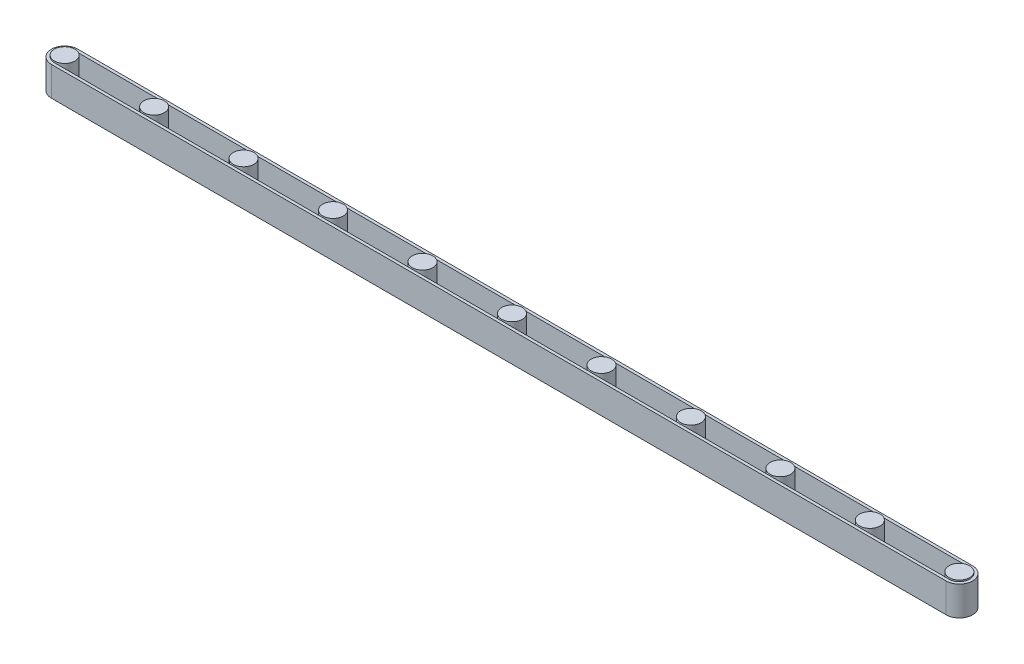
from build123d import *

# Parameters (mm, degrees)
SKETCH1_R              = 35
BOSS_EXTRUDE1_DEPTH    = 55
BOSS_EXTRUDE1_2_DEPTH  = 55
BOSS_EXTRUDE1_3_DEPTH  = 55
BOSS_EXTRUDE1_4_DEPTH  = 55
BOSS_EXTRUDE1_5_DEPTH  = 55
BOSS_EXTRUDE1_6_DEPTH  = 55
BOSS_EXTRUDE1_7_DEPTH  = 55
BOSS_EXTRUDE1_8_DEPTH  = 55
BOSS_EXTRUDE1_9_DEPTH  = 55
BOSS_EXTRUDE1_10_DEPTH = 55
BOSS_EXTRUDE1_11_DEPTH = 55
BOSS_EXTRUDE2_DEPTH    = 50


with BuildPart() as part:
    # Sketch1 → Boss-Extrude1 (new, symmetric)
    with BuildSketch(Plane(origin=(0, 0, 0), x_dir=(1, 0, 0), z_dir=(0, 1, 0))):
        with Locations(Location((0, 0, 0), (0, 0, 270))):
            Circle(SKETCH1_R)
    extrude(amount=BOSS_EXTRUDE1_DEPTH, both=True)


with BuildPart() as body_2:
    # Sketch1 → Boss-Extrude1 2 (new, symmetric)
    with BuildSketch(Plane(origin=(0, 0, 0), x_dir=(1, 0, 0), z_dir=(0, 1, 0))):
        with Locations(Location((3050, 0, 0), (0, 0, 270))):
            Circle(SKETCH1_R)
    extrude(amount=BOSS_EXTRUDE1_2_DEPTH, both=True)


with BuildPart() as body_3:
    # Sketch1 → Boss-Extrude1 3 (new, symmetric)
    with BuildSketch(Plane(origin=(0, 0, 0), x_dir=(1, 0, 0), z_dir=(0, 1, 0))):
        with Locations(Location((305, 0, 0), (0, 0, 270))):
            Circle(SKETCH1_R)
    extrude(amount=BOSS_EXTRUDE1_3_DEPTH, both=True)


with BuildPart() as body_4:
    # Sketch1 → Boss-Extrude1 4 (new, symmetric)
    with BuildSketch(Plane(origin=(0, 0, 0), x_dir=(1, 0, 0), z_dir=(0, 1, 0))):
        with Locations(Location((610, 0, 0), (0, 0, 270))):
            Circle(SKETCH1_R)
    extrude(amount=BOSS_EXTRUDE1_4_DEPTH, both=True)


with BuildPart() as body_5:
    # Sketch1 → Boss-Extrude1 5 (new, symmetric)
    with BuildSketch(Plane(origin=(0, 0, 0), x_dir=(1, 0, 0), z_dir=(0, 1, 0))):
        with Locations(Location((915, 0, 0), (0, 0, 270))):
            Circle(SKETCH1_R)
    extrude(amount=BOSS_EXTRUDE1_5_DEPTH, both=True)


with BuildPart() as body_6:
    # Sketch1 → Boss-Extrude1 6 (new, symmetric)
    with BuildSketch(Plane(origin=(0, 0, 0), x_dir=(1, 0, 0), z_dir=(0, 1, 0))):
        with Locations(Location((1220, 0, 0), (0, 0, 270))):
            Circle(SKETCH1_R)
    extrude(amount=BOSS_EXTRUDE1_6_DEPTH, both=True)


with BuildPart() as body_7:
    # Sketch1 → Boss-Extrude1 7 (new, symmetric)
    with BuildSketch(Plane(origin=(0, 0, 0), x_dir=(1, 0, 0), z_dir=(0, 1, 0))):
        with Locations(Location((1830, 0, 0), (0, 0, 270))):
            Circle(SKETCH1_R)
    extrude(amount=BOSS_EXTRUDE1_7_DEPTH, both=True)


with BuildPart() as body_8:
    # Sketch1 → Boss-Extrude1 8 (new, symmetric)
    with BuildSketch(Plane(origin=(0, 0, 0), x_dir=(1, 0, 0), z_dir=(0, 1, 0))):
        with Locations(Location((1525, 0, 0), (0, 0, 270))):
            Circle(SKETCH1_R)
    extrude(amount=BOSS_EXTRUDE1_8_DEPTH, both=True)


with BuildPart() as body_9:
    # Sketch1 → Boss-Extrude1 9 (new, symmetric)
    with BuildSketch(Plane(origin=(0, 0, 0), x_dir=(1, 0, 0), z_dir=(0, 1, 0))):
        with Locations(Location((2135, 0, 0), (0, 0, 270))):
            Circle(SKETCH1_R)
    extrude(amount=BOSS_EXTRUDE1_9_DEPTH, both=True)


with BuildPart() as body_10:
    # Sketch1 → Boss-Extrude1 10 (new, symmetric)
    with BuildSketch(Plane(origin=(0, 0, 0), x_dir=(1, 0, 0), z_dir=(0, 1, 0))):
        with Locations(Location((2440, 0, 0), (0, 0, 270))):
            Circle(SKETCH1_R)
    extrude(amount=BOSS_EXTRUDE1_10_DEPTH, both=True)


with BuildPart() as body_11:
    # Sketch1 → Boss-Extrude1 11 (new, symmetric)
    with BuildSketch(Plane(origin=(0, 0, 0), x_dir=(1, 0, 0), z_dir=(0, 1, 0))):
        with Locations(Location((2745, 0, 0), (0, 0, 270))):
            Circle(SKETCH1_R)
    extrude(amount=BOSS_EXTRUDE1_11_DEPTH, both=True)


with BuildPart() as body_12:
    # Sketch2 → Boss-Extrude2 (new, symmetric)
    with BuildSketch(Plane(origin=(0, 0, 0), x_dir=(1, 0, 0), z_dir=(0, 1, 0))):
        with BuildLine():
            Line((0, 45), (3050, 45))
            ThreePointArc((3050, 45), (3095, 0), (3050, -45))
            Line((3050, -45), (0, -45))
            ThreePointArc((0, -45), (-45, 0), (0, 45))
        make_face()
        with BuildLine():
            Line((0, 35), (3050, 35))
            ThreePointArc((3050, 35), (3085, 0), (3050, -35))
            Line((3050, -35), (0, -35))
            ThreePointArc((0, -35), (-35, 0), (0, 35))
        make_face(mode=Mode.SUBTRACT)
    extrude(amount=BOSS_EXTRUDE2_DEPTH, both=True)


solid = Compound([part.part, body_2.part, body_3.part, body_4.part, body_5.part, body_6.part, body_7.part, body_8.part, body_9.part, body_10.part, body_11.part, body_12.part])
